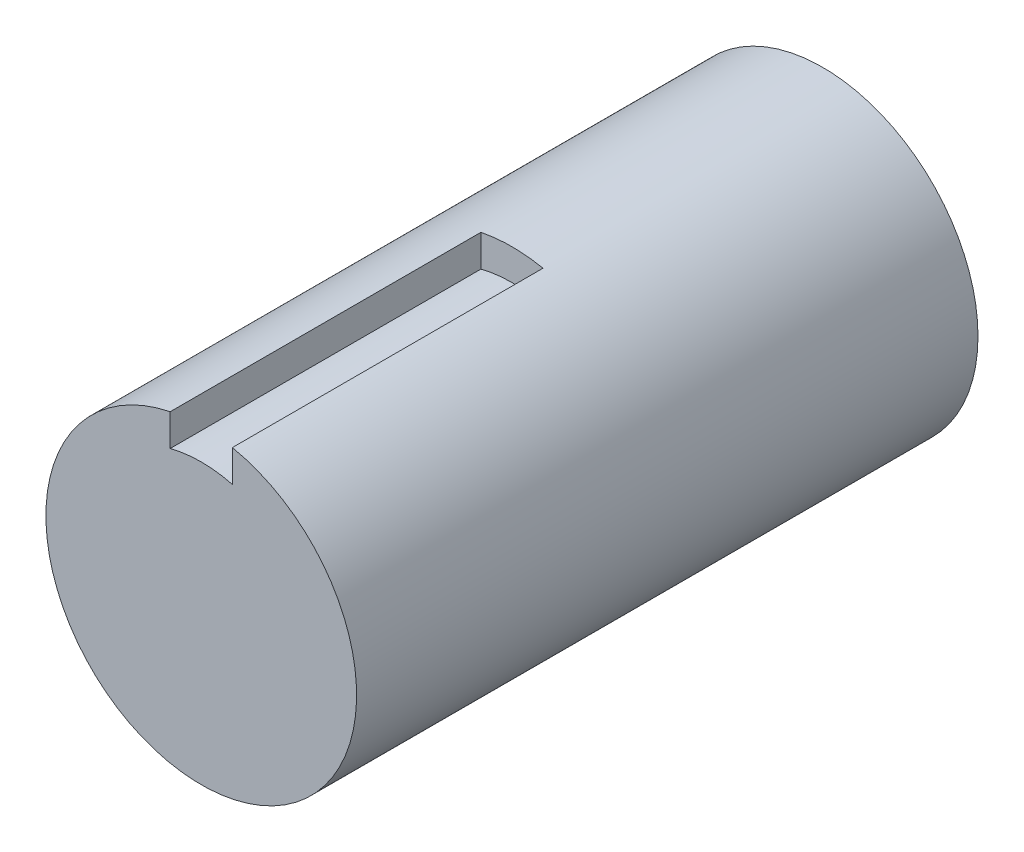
ISO-10303-21;
HEADER;
FILE_DESCRIPTION(('STEP AP214'),'2;1');
FILE_NAME('part.step','',(''),(''),'','','');
FILE_SCHEMA(('AUTOMOTIVE_DESIGN { 1 0 10303 214 1 1 1 1 }'));
ENDSEC;
DATA;
#1=APPLICATION_CONTEXT('core data for automotive mechanical design processes');
#2=APPLICATION_PROTOCOL_DEFINITION('international standard','automotive_design',2000,#1);
#3=PRODUCT_CONTEXT('',#1,'mechanical');
#4=PRODUCT('Part','Part','',(#3));
#5=PRODUCT_RELATED_PRODUCT_CATEGORY('part','',(#4));
#6=PRODUCT_DEFINITION_FORMATION('','',#4);
#7=PRODUCT_DEFINITION_CONTEXT('part definition',#1,'design');
#8=PRODUCT_DEFINITION('design','',#6,#7);
#9=PRODUCT_DEFINITION_SHAPE('','',#8);
#10=(LENGTH_UNIT() NAMED_UNIT(*) SI_UNIT(.MILLI.,.METRE.));
#11=(NAMED_UNIT(*) PLANE_ANGLE_UNIT() SI_UNIT($,.RADIAN.));
#12=(NAMED_UNIT(*) SI_UNIT($,.STERADIAN.) SOLID_ANGLE_UNIT());
#13=UNCERTAINTY_MEASURE_WITH_UNIT(LENGTH_MEASURE(1.E-05),#10,'distance_accuracy_value','');
#14=(GEOMETRIC_REPRESENTATION_CONTEXT(3) GLOBAL_UNCERTAINTY_ASSIGNED_CONTEXT((#13)) GLOBAL_UNIT_ASSIGNED_CONTEXT((#10,
#11,#12)) REPRESENTATION_CONTEXT('',''));
#15=CARTESIAN_POINT('',(0.,0.,0.));
#16=DIRECTION('',(0.,0.,1.));
#17=DIRECTION('',(1.,0.,0.));
#18=AXIS2_PLACEMENT_3D('',#15,#16,#17);
#19=CARTESIAN_POINT('',(0.,0.,200.));
#20=DIRECTION('',(0.,0.,-1.));
#21=DIRECTION('',(-1.,0.,0.));
#22=AXIS2_PLACEMENT_3D('',#19,#20,#21);
#23=CYLINDRICAL_SURFACE('',#22,50.);
#24=CARTESIAN_POINT('',(0.,0.,100.));
#25=DIRECTION('',(0.,0.,1.));
#26=DIRECTION('',(1.,0.,0.));
#27=AXIS2_PLACEMENT_3D('',#24,#25,#26);
#28=CIRCLE('',#27,50.);
#29=CARTESIAN_POINT('',(10.,48.9897948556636,100.));
#30=VERTEX_POINT('',#29);
#31=CARTESIAN_POINT('',(-10.,48.9897948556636,100.));
#32=VERTEX_POINT('',#31);
#33=EDGE_CURVE('E97',#30,#32,#28,.T.);
#34=ORIENTED_EDGE('',*,*,#33,.F.);
#35=DIRECTION('',(0.,0.,1.));
#36=VECTOR('',#35,1.);
#37=CARTESIAN_POINT('',(10.,48.9897948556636,100.));
#38=LINE('',#37,#36);
#39=CARTESIAN_POINT('',(10.,48.9897948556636,200.));
#40=VERTEX_POINT('',#39);
#41=EDGE_CURVE('E59',#30,#40,#38,.T.);
#42=ORIENTED_EDGE('',*,*,#41,.T.);
#43=CARTESIAN_POINT('',(0.,0.,200.));
#44=DIRECTION('',(0.,0.,1.));
#45=DIRECTION('',(1.,0.,0.));
#46=AXIS2_PLACEMENT_3D('',#43,#44,#45);
#47=CIRCLE('',#46,50.);
#48=CARTESIAN_POINT('',(-10.,48.9897948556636,200.));
#49=VERTEX_POINT('',#48);
#50=EDGE_CURVE('E11',#49,#40,#47,.T.);
#51=ORIENTED_EDGE('',*,*,#50,.F.);
#52=DIRECTION('',(0.,0.,1.));
#53=VECTOR('',#52,1.);
#54=CARTESIAN_POINT('',(-10.,48.9897948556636,100.));
#55=LINE('',#54,#53);
#56=EDGE_CURVE('E50',#32,#49,#55,.T.);
#57=ORIENTED_EDGE('',*,*,#56,.F.);
#58=EDGE_LOOP('',(#34,#42,#51,#57));
#59=FACE_BOUND('',#58,.T.);
#60=CARTESIAN_POINT('',(0.,0.,0.));
#61=DIRECTION('',(0.,0.,1.));
#62=DIRECTION('',(1.,0.,0.));
#63=AXIS2_PLACEMENT_3D('',#60,#61,#62);
#64=CIRCLE('',#63,50.);
#65=CARTESIAN_POINT('',(50.,0.,0.));
#66=VERTEX_POINT('',#65);
#67=EDGE_CURVE('E38',#66,#66,#64,.T.);
#68=ORIENTED_EDGE('',*,*,#67,.T.);
#69=EDGE_LOOP('',(#68));
#70=FACE_BOUND('',#69,.T.);
#71=ADVANCED_FACE('F35',(#59,#70),#23,.T.);
#72=CARTESIAN_POINT('',(0.,0.,200.));
#73=DIRECTION('',(0.,0.,1.));
#74=DIRECTION('',(1.,0.,0.));
#75=AXIS2_PLACEMENT_3D('',#72,#73,#74);
#76=PLANE('',#75);
#77=DIRECTION('',(0.,1.,0.));
#78=VECTOR('',#77,1.);
#79=CARTESIAN_POINT('',(10.,48.9897948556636,200.));
#80=LINE('',#79,#78);
#81=CARTESIAN_POINT('',(10.,38.7298334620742,200.));
#82=VERTEX_POINT('',#81);
#83=EDGE_CURVE('E74',#82,#40,#80,.T.);
#84=ORIENTED_EDGE('',*,*,#83,.F.);
#85=CARTESIAN_POINT('',(0.,0.,200.));
#86=DIRECTION('',(0.,0.,-1.));
#87=DIRECTION('',(1.,0.,0.));
#88=AXIS2_PLACEMENT_3D('',#85,#86,#87);
#89=CIRCLE('',#88,40.);
#90=CARTESIAN_POINT('',(-10.,38.7298334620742,200.));
#91=VERTEX_POINT('',#90);
#92=EDGE_CURVE('E103',#91,#82,#89,.T.);
#93=ORIENTED_EDGE('',*,*,#92,.F.);
#94=DIRECTION('',(0.,-1.,0.));
#95=VECTOR('',#94,1.);
#96=CARTESIAN_POINT('',(-10.,48.9897948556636,200.));
#97=LINE('',#96,#95);
#98=EDGE_CURVE('E83',#49,#91,#97,.T.);
#99=ORIENTED_EDGE('',*,*,#98,.F.);
#100=ORIENTED_EDGE('',*,*,#50,.T.);
#101=EDGE_LOOP('',(#84,#93,#99,#100));
#102=FACE_BOUND('',#101,.T.);
#103=ADVANCED_FACE('F110',(#102),#76,.T.);
#104=CARTESIAN_POINT('',(0.,0.,0.));
#105=DIRECTION('',(0.,0.,1.));
#106=DIRECTION('',(1.,0.,0.));
#107=AXIS2_PLACEMENT_3D('',#104,#105,#106);
#108=PLANE('',#107);
#109=ORIENTED_EDGE('',*,*,#67,.F.);
#110=EDGE_LOOP('',(#109));
#111=FACE_BOUND('',#110,.T.);
#112=ADVANCED_FACE('F118',(#111),#108,.F.);
#113=CARTESIAN_POINT('',(10.,48.9897948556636,100.));
#114=DIRECTION('',(1.,0.,0.));
#115=DIRECTION('',(0.,0.,-1.));
#116=AXIS2_PLACEMENT_3D('',#113,#114,#115);
#117=PLANE('',#116);
#118=ORIENTED_EDGE('',*,*,#83,.T.);
#119=ORIENTED_EDGE('',*,*,#41,.F.);
#120=DIRECTION('',(0.,1.,0.));
#121=VECTOR('',#120,1.);
#122=CARTESIAN_POINT('',(10.,48.9897948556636,100.));
#123=LINE('',#122,#121);
#124=CARTESIAN_POINT('',(10.,38.7298334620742,100.));
#125=VERTEX_POINT('',#124);
#126=EDGE_CURVE('E93',#125,#30,#123,.T.);
#127=ORIENTED_EDGE('',*,*,#126,.F.);
#128=DIRECTION('',(0.,0.,1.));
#129=VECTOR('',#128,1.);
#130=CARTESIAN_POINT('',(10.,38.7298334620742,100.));
#131=LINE('',#130,#129);
#132=EDGE_CURVE('E87',#125,#82,#131,.T.);
#133=ORIENTED_EDGE('',*,*,#132,.T.);
#134=EDGE_LOOP('',(#118,#119,#127,#133));
#135=FACE_BOUND('',#134,.T.);
#136=ADVANCED_FACE('F108',(#135),#117,.F.);
#137=CARTESIAN_POINT('',(0.,0.,100.));
#138=DIRECTION('',(0.,0.,1.));
#139=DIRECTION('',(1.,0.,0.));
#140=AXIS2_PLACEMENT_3D('',#137,#138,#139);
#141=CYLINDRICAL_SURFACE('',#140,40.);
#142=ORIENTED_EDGE('',*,*,#92,.T.);
#143=ORIENTED_EDGE('',*,*,#132,.F.);
#144=CARTESIAN_POINT('',(0.,0.,100.));
#145=DIRECTION('',(0.,0.,-1.));
#146=DIRECTION('',(1.,0.,0.));
#147=AXIS2_PLACEMENT_3D('',#144,#145,#146);
#148=CIRCLE('',#147,40.);
#149=CARTESIAN_POINT('',(-10.,38.7298334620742,100.));
#150=VERTEX_POINT('',#149);
#151=EDGE_CURVE('E90',#150,#125,#148,.T.);
#152=ORIENTED_EDGE('',*,*,#151,.F.);
#153=DIRECTION('',(0.,0.,1.));
#154=VECTOR('',#153,1.);
#155=CARTESIAN_POINT('',(-10.,38.7298334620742,100.));
#156=LINE('',#155,#154);
#157=EDGE_CURVE('E80',#150,#91,#156,.T.);
#158=ORIENTED_EDGE('',*,*,#157,.T.);
#159=EDGE_LOOP('',(#142,#143,#152,#158));
#160=FACE_BOUND('',#159,.T.);
#161=ADVANCED_FACE('F91',(#160),#141,.T.);
#162=CARTESIAN_POINT('',(-10.,48.9897948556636,100.));
#163=DIRECTION('',(-1.,0.,0.));
#164=DIRECTION('',(0.,0.,1.));
#165=AXIS2_PLACEMENT_3D('',#162,#163,#164);
#166=PLANE('',#165);
#167=ORIENTED_EDGE('',*,*,#98,.T.);
#168=ORIENTED_EDGE('',*,*,#157,.F.);
#169=DIRECTION('',(0.,-1.,0.));
#170=VECTOR('',#169,1.);
#171=CARTESIAN_POINT('',(-10.,48.9897948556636,100.));
#172=LINE('',#171,#170);
#173=EDGE_CURVE('E78',#32,#150,#172,.T.);
#174=ORIENTED_EDGE('',*,*,#173,.F.);
#175=ORIENTED_EDGE('',*,*,#56,.T.);
#176=EDGE_LOOP('',(#167,#168,#174,#175));
#177=FACE_BOUND('',#176,.T.);
#178=ADVANCED_FACE('F82',(#177),#166,.F.);
#179=CARTESIAN_POINT('',(0.,0.,100.));
#180=DIRECTION('',(0.,0.,1.));
#181=DIRECTION('',(1.,0.,0.));
#182=AXIS2_PLACEMENT_3D('',#179,#180,#181);
#183=PLANE('',#182);
#184=ORIENTED_EDGE('',*,*,#33,.T.);
#185=ORIENTED_EDGE('',*,*,#173,.T.);
#186=ORIENTED_EDGE('',*,*,#151,.T.);
#187=ORIENTED_EDGE('',*,*,#126,.T.);
#188=EDGE_LOOP('',(#184,#185,#186,#187));
#189=FACE_BOUND('',#188,.T.);
#190=ADVANCED_FACE('F95',(#189),#183,.T.);
#191=CLOSED_SHELL('',(#71,#103,#112,#136,#161,#178,#190));
#192=MANIFOLD_SOLID_BREP('B2',#191);
#193=ADVANCED_BREP_SHAPE_REPRESENTATION('',(#18,#192),#14);
#194=SHAPE_DEFINITION_REPRESENTATION(#9,#193);
ENDSEC;
END-ISO-10303-21;
